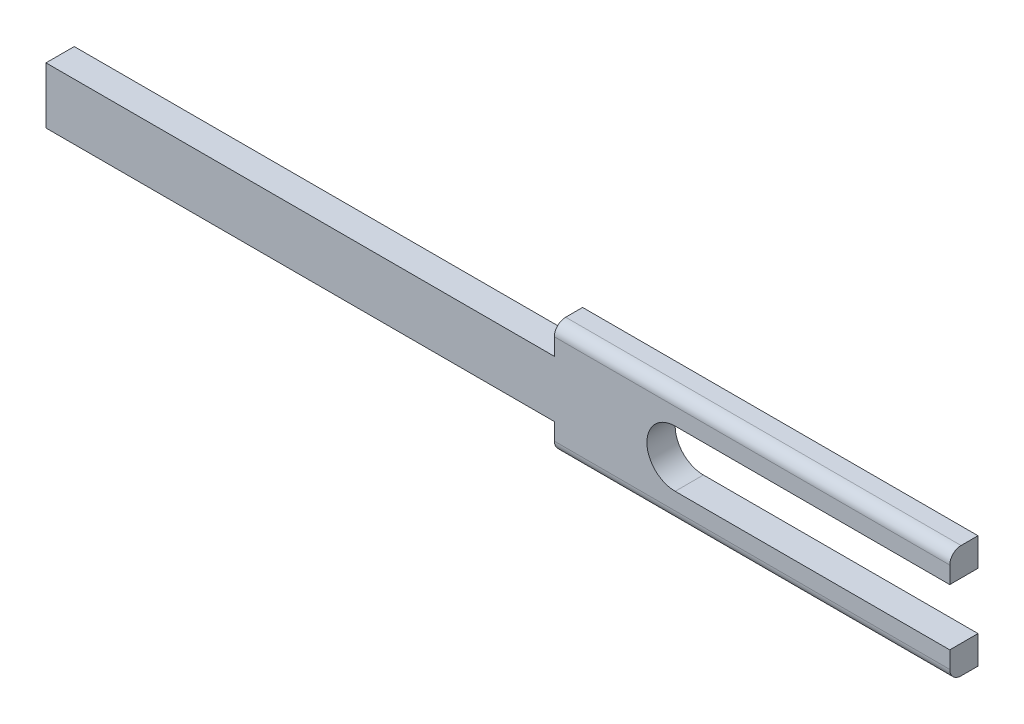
ISO-10303-21;
HEADER;
FILE_DESCRIPTION(('STEP AP214'),'2;1');
FILE_NAME('part.step','',(''),(''),'','','');
FILE_SCHEMA(('AUTOMOTIVE_DESIGN { 1 0 10303 214 1 1 1 1 }'));
ENDSEC;
DATA;
#1=APPLICATION_CONTEXT('core data for automotive mechanical design processes');
#2=APPLICATION_PROTOCOL_DEFINITION('international standard','automotive_design',2000,#1);
#3=PRODUCT_CONTEXT('',#1,'mechanical');
#4=PRODUCT('Part','Part','',(#3));
#5=PRODUCT_RELATED_PRODUCT_CATEGORY('part','',(#4));
#6=PRODUCT_DEFINITION_FORMATION('','',#4);
#7=PRODUCT_DEFINITION_CONTEXT('part definition',#1,'design');
#8=PRODUCT_DEFINITION('design','',#6,#7);
#9=PRODUCT_DEFINITION_SHAPE('','',#8);
#10=(LENGTH_UNIT() NAMED_UNIT(*) SI_UNIT(.MILLI.,.METRE.));
#11=(NAMED_UNIT(*) PLANE_ANGLE_UNIT() SI_UNIT($,.RADIAN.));
#12=(NAMED_UNIT(*) SI_UNIT($,.STERADIAN.) SOLID_ANGLE_UNIT());
#13=UNCERTAINTY_MEASURE_WITH_UNIT(LENGTH_MEASURE(1.E-05),#10,'distance_accuracy_value','');
#14=(GEOMETRIC_REPRESENTATION_CONTEXT(3) GLOBAL_UNCERTAINTY_ASSIGNED_CONTEXT((#13)) GLOBAL_UNIT_ASSIGNED_CONTEXT((#10,
#11,#12)) REPRESENTATION_CONTEXT('',''));
#15=CARTESIAN_POINT('',(0.,0.,0.));
#16=DIRECTION('',(0.,0.,1.));
#17=DIRECTION('',(1.,0.,0.));
#18=AXIS2_PLACEMENT_3D('',#15,#16,#17);
#19=CARTESIAN_POINT('',(41.5248211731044,-15.5615879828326,3.175));
#20=DIRECTION('',(-1.,0.,0.));
#21=DIRECTION('',(0.,0.,1.));
#22=AXIS2_PLACEMENT_3D('',#19,#20,#21);
#23=PLANE('',#22);
#24=DIRECTION('',(0.,0.,-1.));
#25=VECTOR('',#24,1.);
#26=CARTESIAN_POINT('',(41.5248211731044,-9.21158798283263,3.175));
#27=LINE('',#26,#25);
#28=CARTESIAN_POINT('',(41.5248211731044,-9.21158798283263,1.905));
#29=VERTEX_POINT('',#28);
#30=CARTESIAN_POINT('',(41.5248211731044,-9.21158798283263,0.));
#31=VERTEX_POINT('',#30);
#32=EDGE_CURVE('E191',#29,#31,#27,.T.);
#33=ORIENTED_EDGE('',*,*,#32,.F.);
#34=CARTESIAN_POINT('',(41.5248211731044,-10.4815879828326,1.905));
#35=DIRECTION('',(-1.,0.,0.));
#36=DIRECTION('',(0.,0.,1.));
#37=AXIS2_PLACEMENT_3D('',#34,#35,#36);
#38=CIRCLE('',#37,1.27);
#39=CARTESIAN_POINT('',(41.5248211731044,-10.4815879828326,3.175));
#40=VERTEX_POINT('',#39);
#41=EDGE_CURVE('E12',#29,#40,#38,.F.);
#42=ORIENTED_EDGE('',*,*,#41,.T.);
#43=DIRECTION('',(0.,1.,0.));
#44=VECTOR('',#43,1.);
#45=CARTESIAN_POINT('',(41.5248211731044,-15.5615879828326,3.175));
#46=LINE('',#45,#44);
#47=CARTESIAN_POINT('',(41.5248211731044,-12.3865879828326,3.175));
#48=VERTEX_POINT('',#47);
#49=EDGE_CURVE('E200',#48,#40,#46,.T.);
#50=ORIENTED_EDGE('',*,*,#49,.F.);
#51=DIRECTION('',(0.,0.,1.));
#52=VECTOR('',#51,1.);
#53=CARTESIAN_POINT('',(41.5248211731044,-12.3865879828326,3.175));
#54=LINE('',#53,#52);
#55=CARTESIAN_POINT('',(41.5248211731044,-12.3865879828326,0.));
#56=VERTEX_POINT('',#55);
#57=EDGE_CURVE('E189',#56,#48,#54,.T.);
#58=ORIENTED_EDGE('',*,*,#57,.F.);
#59=DIRECTION('',(0.,1.,0.));
#60=VECTOR('',#59,1.);
#61=CARTESIAN_POINT('',(41.5248211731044,-15.5615879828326,0.));
#62=LINE('',#61,#60);
#63=EDGE_CURVE('E193',#56,#31,#62,.T.);
#64=ORIENTED_EDGE('',*,*,#63,.T.);
#65=EDGE_LOOP('',(#33,#42,#50,#58,#64));
#66=FACE_BOUND('',#65,.T.);
#67=ADVANCED_FACE('F32',(#66),#23,.F.);
#68=CARTESIAN_POINT('',(41.5248211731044,-20.6415879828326,3.175));
#69=VERTEX_POINT('',#68);
#70=CARTESIAN_POINT('',(41.5248211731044,-18.7365879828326,3.175));
#71=VERTEX_POINT('',#70);
#72=EDGE_CURVE('E202',#69,#71,#46,.T.);
#73=ORIENTED_EDGE('',*,*,#72,.F.);
#74=CARTESIAN_POINT('',(41.5248211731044,-20.6415879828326,1.905));
#75=DIRECTION('',(-1.,0.,0.));
#76=DIRECTION('',(0.,0.,1.));
#77=AXIS2_PLACEMENT_3D('',#74,#75,#76);
#78=CIRCLE('',#77,1.27);
#79=CARTESIAN_POINT('',(41.5248211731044,-21.9115879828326,1.905));
#80=VERTEX_POINT('',#79);
#81=EDGE_CURVE('E232',#69,#80,#78,.F.);
#82=ORIENTED_EDGE('',*,*,#81,.T.);
#83=DIRECTION('',(0.,0.,1.));
#84=VECTOR('',#83,1.);
#85=CARTESIAN_POINT('',(41.5248211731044,-21.9115879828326,3.175));
#86=LINE('',#85,#84);
#87=CARTESIAN_POINT('',(41.5248211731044,-21.9115879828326,0.));
#88=VERTEX_POINT('',#87);
#89=EDGE_CURVE('E172',#88,#80,#86,.T.);
#90=ORIENTED_EDGE('',*,*,#89,.F.);
#91=CARTESIAN_POINT('',(41.5248211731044,-18.7365879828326,0.));
#92=VERTEX_POINT('',#91);
#93=EDGE_CURVE('E196',#88,#92,#62,.T.);
#94=ORIENTED_EDGE('',*,*,#93,.T.);
#95=DIRECTION('',(0.,0.,-1.));
#96=VECTOR('',#95,1.);
#97=CARTESIAN_POINT('',(41.5248211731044,-18.7365879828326,3.175));
#98=LINE('',#97,#96);
#99=EDGE_CURVE('E187',#71,#92,#98,.T.);
#100=ORIENTED_EDGE('',*,*,#99,.F.);
#101=EDGE_LOOP('',(#73,#82,#90,#94,#100));
#102=FACE_BOUND('',#101,.T.);
#103=ADVANCED_FACE('F252',(#102),#23,.F.);
#104=CARTESIAN_POINT('',(-60.0751788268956,-15.5615879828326,3.175));
#105=DIRECTION('',(-1.,0.,0.));
#106=DIRECTION('',(0.,0.,1.));
#107=AXIS2_PLACEMENT_3D('',#104,#105,#106);
#108=PLANE('',#107);
#109=DIRECTION('',(0.,1.,0.));
#110=VECTOR('',#109,1.);
#111=CARTESIAN_POINT('',(-60.0751788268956,-15.5615879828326,0.));
#112=LINE('',#111,#110);
#113=CARTESIAN_POINT('',(-60.0751788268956,-18.7365879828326,0.));
#114=VERTEX_POINT('',#113);
#115=CARTESIAN_POINT('',(-60.0751788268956,-12.3865879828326,0.));
#116=VERTEX_POINT('',#115);
#117=EDGE_CURVE('E197',#114,#116,#112,.T.);
#118=ORIENTED_EDGE('',*,*,#117,.F.);
#119=DIRECTION('',(0.,0.,1.));
#120=VECTOR('',#119,1.);
#121=CARTESIAN_POINT('',(-60.0751788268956,-18.7365879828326,-0.635));
#122=LINE('',#121,#120);
#123=CARTESIAN_POINT('',(-60.0751788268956,-18.7365879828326,3.175));
#124=VERTEX_POINT('',#123);
#125=EDGE_CURVE('E180',#114,#124,#122,.T.);
#126=ORIENTED_EDGE('',*,*,#125,.T.);
#127=DIRECTION('',(0.,1.,0.));
#128=VECTOR('',#127,1.);
#129=CARTESIAN_POINT('',(-60.0751788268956,-15.5615879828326,3.175));
#130=LINE('',#129,#128);
#131=CARTESIAN_POINT('',(-60.0751788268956,-12.3865879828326,3.175));
#132=VERTEX_POINT('',#131);
#133=EDGE_CURVE('E203',#124,#132,#130,.T.);
#134=ORIENTED_EDGE('',*,*,#133,.T.);
#135=DIRECTION('',(0.,0.,1.));
#136=VECTOR('',#135,1.);
#137=CARTESIAN_POINT('',(-60.0751788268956,-12.3865879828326,-0.635));
#138=LINE('',#137,#136);
#139=EDGE_CURVE('E148',#116,#132,#138,.T.);
#140=ORIENTED_EDGE('',*,*,#139,.F.);
#141=EDGE_LOOP('',(#118,#126,#134,#140));
#142=FACE_BOUND('',#141,.T.);
#143=ADVANCED_FACE('F290',(#142),#108,.T.);
#144=CARTESIAN_POINT('',(-90.8749981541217,-15.5615879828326,3.175));
#145=DIRECTION('',(0.,0.,-1.));
#146=DIRECTION('',(-1.,0.,0.));
#147=AXIS2_PLACEMENT_3D('',#144,#145,#146);
#148=PLANE('',#147);
#149=ORIENTED_EDGE('',*,*,#49,.T.);
#150=DIRECTION('',(-1.,0.,0.));
#151=VECTOR('',#150,1.);
#152=CARTESIAN_POINT('',(-2.92517882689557,-10.4815879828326,3.175));
#153=LINE('',#152,#151);
#154=CARTESIAN_POINT('',(-2.92517882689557,-10.4815879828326,3.175));
#155=VERTEX_POINT('',#154);
#156=EDGE_CURVE('E139',#40,#155,#153,.T.);
#157=ORIENTED_EDGE('',*,*,#156,.T.);
#158=DIRECTION('',(0.,-1.,0.));
#159=VECTOR('',#158,1.);
#160=CARTESIAN_POINT('',(-2.92517882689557,-12.3865879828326,3.175));
#161=LINE('',#160,#159);
#162=CARTESIAN_POINT('',(-2.92517882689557,-12.3865879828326,3.175));
#163=VERTEX_POINT('',#162);
#164=EDGE_CURVE('E130',#155,#163,#161,.T.);
#165=ORIENTED_EDGE('',*,*,#164,.T.);
#166=DIRECTION('',(-1.,0.,0.));
#167=VECTOR('',#166,1.);
#168=CARTESIAN_POINT('',(-2.92517882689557,-12.3865879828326,3.175));
#169=LINE('',#168,#167);
#170=EDGE_CURVE('E136',#163,#132,#169,.T.);
#171=ORIENTED_EDGE('',*,*,#170,.T.);
#172=ORIENTED_EDGE('',*,*,#133,.F.);
#173=DIRECTION('',(1.,0.,0.));
#174=VECTOR('',#173,1.);
#175=CARTESIAN_POINT('',(-2.92517882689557,-18.7365879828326,3.175));
#176=LINE('',#175,#174);
#177=CARTESIAN_POINT('',(-2.92517882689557,-18.7365879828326,3.175));
#178=VERTEX_POINT('',#177);
#179=EDGE_CURVE('E153',#124,#178,#176,.T.);
#180=ORIENTED_EDGE('',*,*,#179,.T.);
#181=DIRECTION('',(0.,-1.,0.));
#182=VECTOR('',#181,1.);
#183=CARTESIAN_POINT('',(-2.92517882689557,-18.7365879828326,3.175));
#184=LINE('',#183,#182);
#185=CARTESIAN_POINT('',(-2.92517882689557,-20.6415879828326,3.175));
#186=VERTEX_POINT('',#185);
#187=EDGE_CURVE('E156',#178,#186,#184,.T.);
#188=ORIENTED_EDGE('',*,*,#187,.T.);
#189=DIRECTION('',(1.,0.,0.));
#190=VECTOR('',#189,1.);
#191=CARTESIAN_POINT('',(41.5248211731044,-20.6415879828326,3.175));
#192=LINE('',#191,#190);
#193=EDGE_CURVE('E229',#186,#69,#192,.T.);
#194=ORIENTED_EDGE('',*,*,#193,.T.);
#195=ORIENTED_EDGE('',*,*,#72,.T.);
#196=DIRECTION('',(-1.,0.,0.));
#197=VECTOR('',#196,1.);
#198=CARTESIAN_POINT('',(43.3286345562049,-18.7365879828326,3.175));
#199=LINE('',#198,#197);
#200=CARTESIAN_POINT('',(10.6529908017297,-18.7365879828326,3.175));
#201=VERTEX_POINT('',#200);
#202=EDGE_CURVE('E161',#71,#201,#199,.T.);
#203=ORIENTED_EDGE('',*,*,#202,.T.);
#204=CARTESIAN_POINT('',(10.6529908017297,-15.5615879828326,3.175));
#205=DIRECTION('',(0.,0.,-1.));
#206=DIRECTION('',(-1.,0.,0.));
#207=AXIS2_PLACEMENT_3D('',#204,#205,#206);
#208=CIRCLE('',#207,3.17499999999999);
#209=CARTESIAN_POINT('',(10.6529908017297,-12.3865879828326,3.175));
#210=VERTEX_POINT('',#209);
#211=EDGE_CURVE('E164',#201,#210,#208,.T.);
#212=ORIENTED_EDGE('',*,*,#211,.T.);
#213=DIRECTION('',(1.,0.,0.));
#214=VECTOR('',#213,1.);
#215=CARTESIAN_POINT('',(43.3286345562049,-12.3865879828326,3.175));
#216=LINE('',#215,#214);
#217=EDGE_CURVE('E167',#210,#48,#216,.T.);
#218=ORIENTED_EDGE('',*,*,#217,.T.);
#219=EDGE_LOOP('',(#149,#157,#165,#171,#172,#180,#188,#194,#195,#203,#212,#218));
#220=FACE_BOUND('',#219,.T.);
#221=ADVANCED_FACE('F133',(#220),#148,.F.);
#222=CARTESIAN_POINT('',(-90.8749981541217,-15.5615879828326,0.));
#223=DIRECTION('',(0.,0.,-1.));
#224=DIRECTION('',(-1.,0.,0.));
#225=AXIS2_PLACEMENT_3D('',#222,#223,#224);
#226=PLANE('',#225);
#227=ORIENTED_EDGE('',*,*,#63,.F.);
#228=DIRECTION('',(-1.,0.,0.));
#229=VECTOR('',#228,1.);
#230=CARTESIAN_POINT('',(-90.8749981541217,-12.3865879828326,0.));
#231=LINE('',#230,#229);
#232=CARTESIAN_POINT('',(10.6529908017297,-12.3865879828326,0.));
#233=VERTEX_POINT('',#232);
#234=EDGE_CURVE('E226',#56,#233,#231,.T.);
#235=ORIENTED_EDGE('',*,*,#234,.T.);
#236=CARTESIAN_POINT('',(10.6529908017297,-15.5615879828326,0.));
#237=DIRECTION('',(0.,0.,-1.));
#238=DIRECTION('',(-1.,0.,0.));
#239=AXIS2_PLACEMENT_3D('',#236,#237,#238);
#240=CIRCLE('',#239,3.17499999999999);
#241=CARTESIAN_POINT('',(10.6529908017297,-18.7365879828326,0.));
#242=VERTEX_POINT('',#241);
#243=EDGE_CURVE('E223',#233,#242,#240,.F.);
#244=ORIENTED_EDGE('',*,*,#243,.T.);
#245=DIRECTION('',(1.,0.,0.));
#246=VECTOR('',#245,1.);
#247=CARTESIAN_POINT('',(-90.8749981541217,-18.7365879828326,0.));
#248=LINE('',#247,#246);
#249=EDGE_CURVE('E220',#242,#92,#248,.T.);
#250=ORIENTED_EDGE('',*,*,#249,.T.);
#251=ORIENTED_EDGE('',*,*,#93,.F.);
#252=DIRECTION('',(-1.,0.,0.));
#253=VECTOR('',#252,1.);
#254=CARTESIAN_POINT('',(-90.8749981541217,-21.9115879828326,0.));
#255=LINE('',#254,#253);
#256=CARTESIAN_POINT('',(-2.92517882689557,-21.9115879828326,0.));
#257=VERTEX_POINT('',#256);
#258=EDGE_CURVE('E217',#88,#257,#255,.T.);
#259=ORIENTED_EDGE('',*,*,#258,.T.);
#260=DIRECTION('',(0.,1.,0.));
#261=VECTOR('',#260,1.);
#262=CARTESIAN_POINT('',(-2.92517882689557,-15.5615879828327,0.));
#263=LINE('',#262,#261);
#264=CARTESIAN_POINT('',(-2.92517882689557,-18.7365879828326,0.));
#265=VERTEX_POINT('',#264);
#266=EDGE_CURVE('E214',#257,#265,#263,.T.);
#267=ORIENTED_EDGE('',*,*,#266,.T.);
#268=DIRECTION('',(-1.,0.,0.));
#269=VECTOR('',#268,1.);
#270=CARTESIAN_POINT('',(-90.8749981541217,-18.7365879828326,0.));
#271=LINE('',#270,#269);
#272=EDGE_CURVE('E211',#265,#114,#271,.T.);
#273=ORIENTED_EDGE('',*,*,#272,.T.);
#274=ORIENTED_EDGE('',*,*,#117,.T.);
#275=DIRECTION('',(1.,0.,0.));
#276=VECTOR('',#275,1.);
#277=CARTESIAN_POINT('',(-90.8749981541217,-12.3865879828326,0.));
#278=LINE('',#277,#276);
#279=CARTESIAN_POINT('',(-2.92517882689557,-12.3865879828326,0.));
#280=VERTEX_POINT('',#279);
#281=EDGE_CURVE('E206',#116,#280,#278,.T.);
#282=ORIENTED_EDGE('',*,*,#281,.T.);
#283=DIRECTION('',(0.,1.,0.));
#284=VECTOR('',#283,1.);
#285=CARTESIAN_POINT('',(-2.92517882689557,-15.5615879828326,0.));
#286=LINE('',#285,#284);
#287=CARTESIAN_POINT('',(-2.92517882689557,-9.21158798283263,0.));
#288=VERTEX_POINT('',#287);
#289=EDGE_CURVE('E145',#280,#288,#286,.T.);
#290=ORIENTED_EDGE('',*,*,#289,.T.);
#291=DIRECTION('',(1.,0.,0.));
#292=VECTOR('',#291,1.);
#293=CARTESIAN_POINT('',(-90.8749981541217,-9.21158798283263,0.));
#294=LINE('',#293,#292);
#295=EDGE_CURVE('E208',#288,#31,#294,.T.);
#296=ORIENTED_EDGE('',*,*,#295,.T.);
#297=EDGE_LOOP('',(#227,#235,#244,#250,#251,#259,#267,#273,#274,#282,#290,#296));
#298=FACE_BOUND('',#297,.T.);
#299=ADVANCED_FACE('F260',(#298),#226,.T.);
#300=CARTESIAN_POINT('',(-2.92517882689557,-12.3865879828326,-0.635));
#301=DIRECTION('',(-1.,0.,0.));
#302=DIRECTION('',(0.,-1.,0.));
#303=AXIS2_PLACEMENT_3D('',#300,#301,#302);
#304=PLANE('',#303);
#305=ORIENTED_EDGE('',*,*,#164,.F.);
#306=CARTESIAN_POINT('',(-2.92517882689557,-10.4815879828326,1.905));
#307=DIRECTION('',(-1.,0.,0.));
#308=DIRECTION('',(0.,-1.,0.));
#309=AXIS2_PLACEMENT_3D('',#306,#307,#308);
#310=CIRCLE('',#309,1.27);
#311=CARTESIAN_POINT('',(-2.92517882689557,-9.21158798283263,1.905));
#312=VERTEX_POINT('',#311);
#313=EDGE_CURVE('E53',#155,#312,#310,.T.);
#314=ORIENTED_EDGE('',*,*,#313,.T.);
#315=DIRECTION('',(0.,0.,1.));
#316=VECTOR('',#315,1.);
#317=CARTESIAN_POINT('',(-2.92517882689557,-9.21158798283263,-0.635));
#318=LINE('',#317,#316);
#319=EDGE_CURVE('E149',#288,#312,#318,.T.);
#320=ORIENTED_EDGE('',*,*,#319,.F.);
#321=ORIENTED_EDGE('',*,*,#289,.F.);
#322=DIRECTION('',(0.,0.,1.));
#323=VECTOR('',#322,1.);
#324=CARTESIAN_POINT('',(-2.92517882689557,-12.3865879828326,-0.635));
#325=LINE('',#324,#323);
#326=EDGE_CURVE('E142',#280,#163,#325,.T.);
#327=ORIENTED_EDGE('',*,*,#326,.T.);
#328=EDGE_LOOP('',(#305,#314,#320,#321,#327));
#329=FACE_BOUND('',#328,.T.);
#330=ADVANCED_FACE('F143',(#329),#304,.T.);
#331=CARTESIAN_POINT('',(-2.92517882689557,-12.3865879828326,-0.635));
#332=DIRECTION('',(0.,1.,0.));
#333=DIRECTION('',(-1.,0.,0.));
#334=AXIS2_PLACEMENT_3D('',#331,#332,#333);
#335=PLANE('',#334);
#336=ORIENTED_EDGE('',*,*,#139,.T.);
#337=ORIENTED_EDGE('',*,*,#170,.F.);
#338=ORIENTED_EDGE('',*,*,#326,.F.);
#339=ORIENTED_EDGE('',*,*,#281,.F.);
#340=EDGE_LOOP('',(#336,#337,#338,#339));
#341=FACE_BOUND('',#340,.T.);
#342=ADVANCED_FACE('F151',(#341),#335,.T.);
#343=CARTESIAN_POINT('',(-2.92517882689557,-9.21158798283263,-0.635));
#344=DIRECTION('',(0.,1.,0.));
#345=DIRECTION('',(0.,0.,1.));
#346=AXIS2_PLACEMENT_3D('',#343,#344,#345);
#347=PLANE('',#346);
#348=ORIENTED_EDGE('',*,*,#319,.T.);
#349=DIRECTION('',(-1.,0.,0.));
#350=VECTOR('',#349,1.);
#351=CARTESIAN_POINT('',(41.5248211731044,-9.21158798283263,1.905));
#352=LINE('',#351,#350);
#353=EDGE_CURVE('E39',#312,#29,#352,.F.);
#354=ORIENTED_EDGE('',*,*,#353,.T.);
#355=ORIENTED_EDGE('',*,*,#32,.T.);
#356=ORIENTED_EDGE('',*,*,#295,.F.);
#357=EDGE_LOOP('',(#348,#354,#355,#356));
#358=FACE_BOUND('',#357,.T.);
#359=ADVANCED_FACE('F276',(#358),#347,.T.);
#360=CARTESIAN_POINT('',(-2.92517882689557,-18.7365879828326,-0.635));
#361=DIRECTION('',(0.,-1.,0.));
#362=DIRECTION('',(1.,0.,0.));
#363=AXIS2_PLACEMENT_3D('',#360,#361,#362);
#364=PLANE('',#363);
#365=DIRECTION('',(0.,0.,1.));
#366=VECTOR('',#365,1.);
#367=CARTESIAN_POINT('',(-2.92517882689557,-18.7365879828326,-0.635));
#368=LINE('',#367,#366);
#369=EDGE_CURVE('E178',#265,#178,#368,.T.);
#370=ORIENTED_EDGE('',*,*,#369,.T.);
#371=ORIENTED_EDGE('',*,*,#179,.F.);
#372=ORIENTED_EDGE('',*,*,#125,.F.);
#373=ORIENTED_EDGE('',*,*,#272,.F.);
#374=EDGE_LOOP('',(#370,#371,#372,#373));
#375=FACE_BOUND('',#374,.T.);
#376=ADVANCED_FACE('F305',(#375),#364,.T.);
#377=CARTESIAN_POINT('',(-2.92517882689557,-18.7365879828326,-0.635));
#378=DIRECTION('',(-1.,0.,0.));
#379=DIRECTION('',(0.,-1.,0.));
#380=AXIS2_PLACEMENT_3D('',#377,#378,#379);
#381=PLANE('',#380);
#382=DIRECTION('',(0.,0.,1.));
#383=VECTOR('',#382,1.);
#384=CARTESIAN_POINT('',(-2.92517882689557,-21.9115879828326,-0.635));
#385=LINE('',#384,#383);
#386=CARTESIAN_POINT('',(-2.92517882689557,-21.9115879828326,1.905));
#387=VERTEX_POINT('',#386);
#388=EDGE_CURVE('E175',#257,#387,#385,.T.);
#389=ORIENTED_EDGE('',*,*,#388,.T.);
#390=CARTESIAN_POINT('',(-2.92517882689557,-20.6415879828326,1.905));
#391=DIRECTION('',(-1.,0.,0.));
#392=DIRECTION('',(0.,-1.,0.));
#393=AXIS2_PLACEMENT_3D('',#390,#391,#392);
#394=CIRCLE('',#393,1.27);
#395=EDGE_CURVE('E236',#387,#186,#394,.T.);
#396=ORIENTED_EDGE('',*,*,#395,.T.);
#397=ORIENTED_EDGE('',*,*,#187,.F.);
#398=ORIENTED_EDGE('',*,*,#369,.F.);
#399=ORIENTED_EDGE('',*,*,#266,.F.);
#400=EDGE_LOOP('',(#389,#396,#397,#398,#399));
#401=FACE_BOUND('',#400,.T.);
#402=ADVANCED_FACE('F242',(#401),#381,.T.);
#403=CARTESIAN_POINT('',(-2.92517882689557,-21.9115879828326,-0.635));
#404=DIRECTION('',(0.,-1.,0.));
#405=DIRECTION('',(0.,0.,-1.));
#406=AXIS2_PLACEMENT_3D('',#403,#404,#405);
#407=PLANE('',#406);
#408=ORIENTED_EDGE('',*,*,#89,.T.);
#409=DIRECTION('',(1.,0.,0.));
#410=VECTOR('',#409,1.);
#411=CARTESIAN_POINT('',(-2.92517882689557,-21.9115879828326,1.905));
#412=LINE('',#411,#410);
#413=EDGE_CURVE('E234',#80,#387,#412,.F.);
#414=ORIENTED_EDGE('',*,*,#413,.T.);
#415=ORIENTED_EDGE('',*,*,#388,.F.);
#416=ORIENTED_EDGE('',*,*,#258,.F.);
#417=EDGE_LOOP('',(#408,#414,#415,#416));
#418=FACE_BOUND('',#417,.T.);
#419=ADVANCED_FACE('F257',(#418),#407,.T.);
#420=CARTESIAN_POINT('',(43.3286345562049,-12.3865879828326,-0.635));
#421=DIRECTION('',(0.,-1.,0.));
#422=DIRECTION('',(1.,0.,0.));
#423=AXIS2_PLACEMENT_3D('',#420,#421,#422);
#424=PLANE('',#423);
#425=ORIENTED_EDGE('',*,*,#57,.T.);
#426=ORIENTED_EDGE('',*,*,#217,.F.);
#427=DIRECTION('',(0.,0.,1.));
#428=VECTOR('',#427,1.);
#429=CARTESIAN_POINT('',(10.6529908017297,-12.3865879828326,-0.635));
#430=LINE('',#429,#428);
#431=EDGE_CURVE('E170',#233,#210,#430,.T.);
#432=ORIENTED_EDGE('',*,*,#431,.F.);
#433=ORIENTED_EDGE('',*,*,#234,.F.);
#434=EDGE_LOOP('',(#425,#426,#432,#433));
#435=FACE_BOUND('',#434,.T.);
#436=ADVANCED_FACE('F272',(#435),#424,.T.);
#437=CARTESIAN_POINT('',(43.3286345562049,-18.7365879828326,-0.635));
#438=DIRECTION('',(0.,1.,0.));
#439=DIRECTION('',(-1.,0.,0.));
#440=AXIS2_PLACEMENT_3D('',#437,#438,#439);
#441=PLANE('',#440);
#442=ORIENTED_EDGE('',*,*,#99,.T.);
#443=ORIENTED_EDGE('',*,*,#249,.F.);
#444=DIRECTION('',(0.,0.,1.));
#445=VECTOR('',#444,1.);
#446=CARTESIAN_POINT('',(10.6529908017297,-18.7365879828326,-0.635));
#447=LINE('',#446,#445);
#448=EDGE_CURVE('E173',#242,#201,#447,.T.);
#449=ORIENTED_EDGE('',*,*,#448,.T.);
#450=ORIENTED_EDGE('',*,*,#202,.F.);
#451=EDGE_LOOP('',(#442,#443,#449,#450));
#452=FACE_BOUND('',#451,.T.);
#453=ADVANCED_FACE('F263',(#452),#441,.T.);
#454=CARTESIAN_POINT('',(10.6529908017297,-15.5615879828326,-0.635));
#455=DIRECTION('',(0.,0.,1.));
#456=DIRECTION('',(1.,0.,0.));
#457=AXIS2_PLACEMENT_3D('',#454,#455,#456);
#458=CYLINDRICAL_SURFACE('',#457,3.17499999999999);
#459=ORIENTED_EDGE('',*,*,#431,.T.);
#460=ORIENTED_EDGE('',*,*,#211,.F.);
#461=ORIENTED_EDGE('',*,*,#448,.F.);
#462=ORIENTED_EDGE('',*,*,#243,.F.);
#463=EDGE_LOOP('',(#459,#460,#461,#462));
#464=FACE_BOUND('',#463,.T.);
#465=ADVANCED_FACE('F269',(#464),#458,.F.);
#466=CARTESIAN_POINT('',(-90.8749981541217,-20.6415879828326,1.905));
#467=DIRECTION('',(-1.,0.,0.));
#468=DIRECTION('',(0.,0.,1.));
#469=AXIS2_PLACEMENT_3D('',#466,#467,#468);
#470=CYLINDRICAL_SURFACE('',#469,1.27);
#471=ORIENTED_EDGE('',*,*,#395,.F.);
#472=ORIENTED_EDGE('',*,*,#413,.F.);
#473=ORIENTED_EDGE('',*,*,#81,.F.);
#474=ORIENTED_EDGE('',*,*,#193,.F.);
#475=EDGE_LOOP('',(#471,#472,#473,#474));
#476=FACE_BOUND('',#475,.T.);
#477=ADVANCED_FACE('F249',(#476),#470,.T.);
#478=CARTESIAN_POINT('',(-90.8749981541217,-10.4815879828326,1.905));
#479=DIRECTION('',(1.,0.,0.));
#480=DIRECTION('',(0.,0.,-1.));
#481=AXIS2_PLACEMENT_3D('',#478,#479,#480);
#482=CYLINDRICAL_SURFACE('',#481,1.27);
#483=ORIENTED_EDGE('',*,*,#41,.F.);
#484=ORIENTED_EDGE('',*,*,#353,.F.);
#485=ORIENTED_EDGE('',*,*,#313,.F.);
#486=ORIENTED_EDGE('',*,*,#156,.F.);
#487=EDGE_LOOP('',(#483,#484,#485,#486));
#488=FACE_BOUND('',#487,.T.);
#489=ADVANCED_FACE('F279',(#488),#482,.T.);
#490=CLOSED_SHELL('',(#67,#103,#143,#221,#299,#330,#342,#359,#376,#402,#419,#436,#453,#465,#477,#489));
#491=MANIFOLD_SOLID_BREP('B2',#490);
#492=ADVANCED_BREP_SHAPE_REPRESENTATION('',(#18,#491),#14);
#493=SHAPE_DEFINITION_REPRESENTATION(#9,#492);
ENDSEC;
END-ISO-10303-21;
